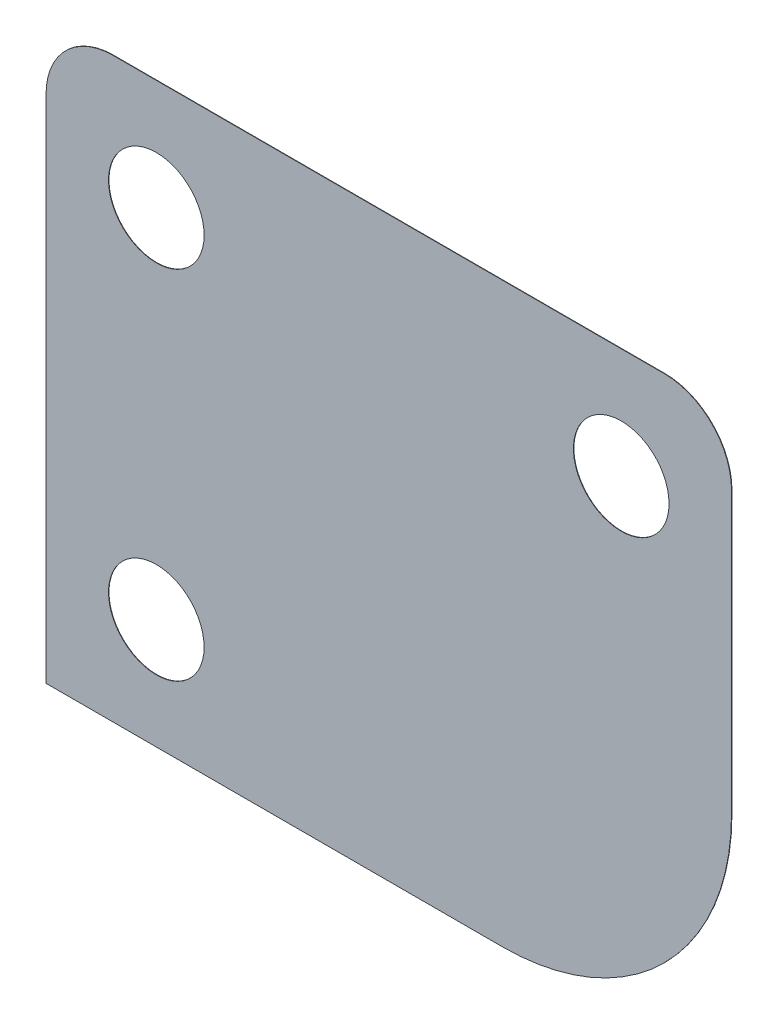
from build123d import *

# Parameters (mm, degrees)
BOSS_EXTRUDE1_DEPTH = 0.0254
HOLE1_D             = 5.6134


with BuildPart() as part:
    # Sketch1 → Boss-Extrude1 (new body)
    with BuildSketch(Plane.XY):
        with BuildLine():
            Line((-504.564152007, -26.617840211), (-504.564152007, -10.107840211))
            ThreePointArc((-504.564152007, -10.107840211), (-505.717272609, -7.323960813), (-508.501152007, -6.170840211))
            Line((-508.501152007, -6.170840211), (-540.886152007, -6.170840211))
            ThreePointArc((-540.886152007, -6.170840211), (-543.670031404, -7.323960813), (-544.823152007, -10.107840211))
            Line((-544.823152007, -10.107840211), (-544.823152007, -40.079840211))
            Line((-544.823152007, -40.079840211), (-518.026152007, -40.079840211))
            ThreePointArc((-518.026152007, -40.079840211), (-508.507080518, -36.136911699), (-504.564152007, -26.617840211))
        make_face()
    extrude(amount=BOSS_EXTRUDE1_DEPTH)

    # Hole1 (through all)
    with Locations(Plane(origin=(-542.00041276, -2.046699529, 0.0254), x_dir=(1, 0, 0), z_dir=(0, 0, 1))):
        with Locations((3.654260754, -10.601140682), (3.654260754, -31.556140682), (30.959260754, -10.601140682)):
            Hole(HOLE1_D / 2)


solid = part.part
